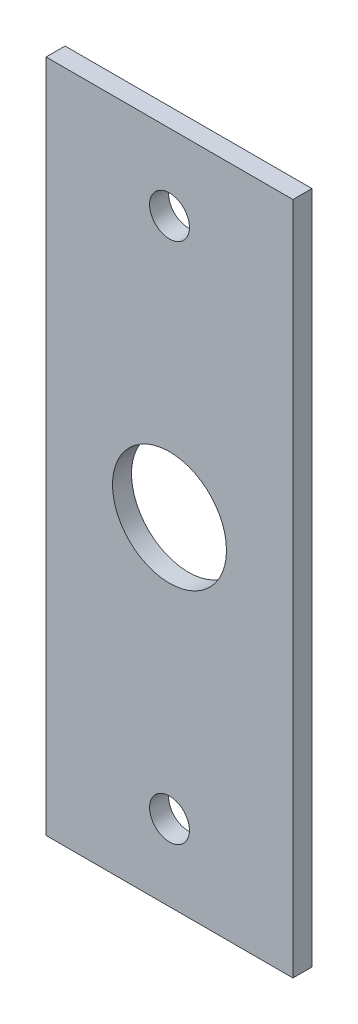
ISO-10303-21;
HEADER;
FILE_DESCRIPTION(('STEP AP214'),'2;1');
FILE_NAME('part.step','',(''),(''),'','','');
FILE_SCHEMA(('AUTOMOTIVE_DESIGN { 1 0 10303 214 1 1 1 1 }'));
ENDSEC;
DATA;
#1=APPLICATION_CONTEXT('core data for automotive mechanical design processes');
#2=APPLICATION_PROTOCOL_DEFINITION('international standard','automotive_design',2000,#1);
#3=PRODUCT_CONTEXT('',#1,'mechanical');
#4=PRODUCT('Part','Part','',(#3));
#5=PRODUCT_RELATED_PRODUCT_CATEGORY('part','',(#4));
#6=PRODUCT_DEFINITION_FORMATION('','',#4);
#7=PRODUCT_DEFINITION_CONTEXT('part definition',#1,'design');
#8=PRODUCT_DEFINITION('design','',#6,#7);
#9=PRODUCT_DEFINITION_SHAPE('','',#8);
#10=(LENGTH_UNIT() NAMED_UNIT(*) SI_UNIT(.MILLI.,.METRE.));
#11=(NAMED_UNIT(*) PLANE_ANGLE_UNIT() SI_UNIT($,.RADIAN.));
#12=(NAMED_UNIT(*) SI_UNIT($,.STERADIAN.) SOLID_ANGLE_UNIT());
#13=UNCERTAINTY_MEASURE_WITH_UNIT(LENGTH_MEASURE(1.E-05),#10,'distance_accuracy_value','');
#14=(GEOMETRIC_REPRESENTATION_CONTEXT(3) GLOBAL_UNCERTAINTY_ASSIGNED_CONTEXT((#13)) GLOBAL_UNIT_ASSIGNED_CONTEXT((#10,
#11,#12)) REPRESENTATION_CONTEXT('',''));
#15=CARTESIAN_POINT('',(0.,0.,0.));
#16=DIRECTION('',(0.,0.,1.));
#17=DIRECTION('',(1.,0.,0.));
#18=AXIS2_PLACEMENT_3D('',#15,#16,#17);
#19=CARTESIAN_POINT('',(-15.,35.5,2.));
#20=DIRECTION('',(0.,-1.,0.));
#21=DIRECTION('',(0.,0.,-1.));
#22=AXIS2_PLACEMENT_3D('',#19,#20,#21);
#23=PLANE('',#22);
#24=DIRECTION('',(0.,0.,-1.));
#25=VECTOR('',#24,1.);
#26=CARTESIAN_POINT('',(-13.,35.5,2.));
#27=LINE('',#26,#25);
#28=CARTESIAN_POINT('',(-13.,35.5,2.));
#29=VERTEX_POINT('',#28);
#30=CARTESIAN_POINT('',(-13.,35.5,0.));
#31=VERTEX_POINT('',#30);
#32=EDGE_CURVE('E57',#29,#31,#27,.T.);
#33=ORIENTED_EDGE('',*,*,#32,.F.);
#34=DIRECTION('',(-1.,0.,0.));
#35=VECTOR('',#34,1.);
#36=CARTESIAN_POINT('',(-15.,35.5,2.));
#37=LINE('',#36,#35);
#38=CARTESIAN_POINT('',(13.,35.5,2.));
#39=VERTEX_POINT('',#38);
#40=EDGE_CURVE('E49',#39,#29,#37,.T.);
#41=ORIENTED_EDGE('',*,*,#40,.F.);
#42=DIRECTION('',(0.,0.,1.));
#43=VECTOR('',#42,1.);
#44=CARTESIAN_POINT('',(13.,35.5,0.));
#45=LINE('',#44,#43);
#46=CARTESIAN_POINT('',(13.,35.5,0.));
#47=VERTEX_POINT('',#46);
#48=EDGE_CURVE('E122',#47,#39,#45,.T.);
#49=ORIENTED_EDGE('',*,*,#48,.F.);
#50=DIRECTION('',(-1.,0.,0.));
#51=VECTOR('',#50,1.);
#52=CARTESIAN_POINT('',(-15.,35.5,0.));
#53=LINE('',#52,#51);
#54=EDGE_CURVE('E95',#47,#31,#53,.T.);
#55=ORIENTED_EDGE('',*,*,#54,.T.);
#56=EDGE_LOOP('',(#33,#41,#49,#55));
#57=FACE_BOUND('',#56,.T.);
#58=ADVANCED_FACE('F41',(#57),#23,.F.);
#59=CARTESIAN_POINT('',(-15.,-35.5,2.));
#60=DIRECTION('',(0.,1.,0.));
#61=DIRECTION('',(0.,0.,1.));
#62=AXIS2_PLACEMENT_3D('',#59,#60,#61);
#63=PLANE('',#62);
#64=DIRECTION('',(0.,0.,1.));
#65=VECTOR('',#64,1.);
#66=CARTESIAN_POINT('',(-13.,-35.5,0.));
#67=LINE('',#66,#65);
#68=CARTESIAN_POINT('',(-13.,-35.5,0.));
#69=VERTEX_POINT('',#68);
#70=CARTESIAN_POINT('',(-13.,-35.5,2.));
#71=VERTEX_POINT('',#70);
#72=EDGE_CURVE('E82',#69,#71,#67,.T.);
#73=ORIENTED_EDGE('',*,*,#72,.F.);
#74=DIRECTION('',(1.,0.,0.));
#75=VECTOR('',#74,1.);
#76=CARTESIAN_POINT('',(-15.,-35.5,0.));
#77=LINE('',#76,#75);
#78=CARTESIAN_POINT('',(13.,-35.5,0.));
#79=VERTEX_POINT('',#78);
#80=EDGE_CURVE('E44',#69,#79,#77,.T.);
#81=ORIENTED_EDGE('',*,*,#80,.T.);
#82=DIRECTION('',(0.,0.,-1.));
#83=VECTOR('',#82,1.);
#84=CARTESIAN_POINT('',(13.,-35.5,2.));
#85=LINE('',#84,#83);
#86=CARTESIAN_POINT('',(13.,-35.5,2.));
#87=VERTEX_POINT('',#86);
#88=EDGE_CURVE('E125',#87,#79,#85,.T.);
#89=ORIENTED_EDGE('',*,*,#88,.F.);
#90=DIRECTION('',(1.,0.,0.));
#91=VECTOR('',#90,1.);
#92=CARTESIAN_POINT('',(-15.,-35.5,2.));
#93=LINE('',#92,#91);
#94=EDGE_CURVE('E11',#71,#87,#93,.T.);
#95=ORIENTED_EDGE('',*,*,#94,.F.);
#96=EDGE_LOOP('',(#73,#81,#89,#95));
#97=FACE_BOUND('',#96,.T.);
#98=ADVANCED_FACE('F89',(#97),#63,.F.);
#99=CARTESIAN_POINT('',(0.,0.,2.));
#100=DIRECTION('',(0.,0.,1.));
#101=DIRECTION('',(1.,0.,0.));
#102=AXIS2_PLACEMENT_3D('',#99,#100,#101);
#103=PLANE('',#102);
#104=CARTESIAN_POINT('',(0.,27.5,2.));
#105=DIRECTION('',(0.,0.,1.));
#106=DIRECTION('',(1.,0.,0.));
#107=AXIS2_PLACEMENT_3D('',#104,#105,#106);
#108=CIRCLE('',#107,2.1);
#109=CARTESIAN_POINT('',(2.1,27.5,2.));
#110=VERTEX_POINT('',#109);
#111=EDGE_CURVE('E116',#110,#110,#108,.T.);
#112=ORIENTED_EDGE('',*,*,#111,.F.);
#113=EDGE_LOOP('',(#112));
#114=FACE_BOUND('',#113,.T.);
#115=CARTESIAN_POINT('',(0.,-27.5,2.));
#116=DIRECTION('',(0.,0.,1.));
#117=DIRECTION('',(1.,0.,0.));
#118=AXIS2_PLACEMENT_3D('',#115,#116,#117);
#119=CIRCLE('',#118,2.1);
#120=CARTESIAN_POINT('',(2.1,-27.5,2.));
#121=VERTEX_POINT('',#120);
#122=EDGE_CURVE('E110',#121,#121,#119,.T.);
#123=ORIENTED_EDGE('',*,*,#122,.F.);
#124=EDGE_LOOP('',(#123));
#125=FACE_BOUND('',#124,.T.);
#126=CARTESIAN_POINT('',(0.,0.,2.));
#127=DIRECTION('',(0.,0.,1.));
#128=DIRECTION('',(1.,0.,0.));
#129=AXIS2_PLACEMENT_3D('',#126,#127,#128);
#130=CIRCLE('',#129,6.);
#131=CARTESIAN_POINT('',(6.,0.,2.));
#132=VERTEX_POINT('',#131);
#133=EDGE_CURVE('E102',#132,#132,#130,.T.);
#134=ORIENTED_EDGE('',*,*,#133,.F.);
#135=EDGE_LOOP('',(#134));
#136=FACE_BOUND('',#135,.T.);
#137=ORIENTED_EDGE('',*,*,#40,.T.);
#138=DIRECTION('',(0.,1.,0.));
#139=VECTOR('',#138,1.);
#140=CARTESIAN_POINT('',(-13.,-35.5,2.));
#141=LINE('',#140,#139);
#142=EDGE_CURVE('E90',#71,#29,#141,.T.);
#143=ORIENTED_EDGE('',*,*,#142,.F.);
#144=ORIENTED_EDGE('',*,*,#94,.T.);
#145=DIRECTION('',(0.,-1.,0.));
#146=VECTOR('',#145,1.);
#147=CARTESIAN_POINT('',(13.,35.5,2.));
#148=LINE('',#147,#146);
#149=EDGE_CURVE('E119',#39,#87,#148,.T.);
#150=ORIENTED_EDGE('',*,*,#149,.F.);
#151=EDGE_LOOP('',(#137,#143,#144,#150));
#152=FACE_BOUND('',#151,.T.);
#153=ADVANCED_FACE('F131',(#114,#125,#136,#152),#103,.T.);
#154=CARTESIAN_POINT('',(0.,0.,0.));
#155=DIRECTION('',(0.,0.,1.));
#156=DIRECTION('',(1.,0.,0.));
#157=AXIS2_PLACEMENT_3D('',#154,#155,#156);
#158=PLANE('',#157);
#159=CARTESIAN_POINT('',(0.,27.5,0.));
#160=DIRECTION('',(0.,0.,1.));
#161=DIRECTION('',(1.,0.,0.));
#162=AXIS2_PLACEMENT_3D('',#159,#160,#161);
#163=CIRCLE('',#162,2.1);
#164=CARTESIAN_POINT('',(2.1,27.5,0.));
#165=VERTEX_POINT('',#164);
#166=EDGE_CURVE('E113',#165,#165,#163,.T.);
#167=ORIENTED_EDGE('',*,*,#166,.T.);
#168=EDGE_LOOP('',(#167));
#169=FACE_BOUND('',#168,.T.);
#170=CARTESIAN_POINT('',(0.,-27.5,0.));
#171=DIRECTION('',(0.,0.,1.));
#172=DIRECTION('',(1.,0.,0.));
#173=AXIS2_PLACEMENT_3D('',#170,#171,#172);
#174=CIRCLE('',#173,2.1);
#175=CARTESIAN_POINT('',(2.1,-27.5,0.));
#176=VERTEX_POINT('',#175);
#177=EDGE_CURVE('E106',#176,#176,#174,.T.);
#178=ORIENTED_EDGE('',*,*,#177,.T.);
#179=EDGE_LOOP('',(#178));
#180=FACE_BOUND('',#179,.T.);
#181=CARTESIAN_POINT('',(0.,0.,0.));
#182=DIRECTION('',(0.,0.,1.));
#183=DIRECTION('',(1.,0.,0.));
#184=AXIS2_PLACEMENT_3D('',#181,#182,#183);
#185=CIRCLE('',#184,6.);
#186=CARTESIAN_POINT('',(6.,0.,0.));
#187=VERTEX_POINT('',#186);
#188=EDGE_CURVE('E98',#187,#187,#185,.T.);
#189=ORIENTED_EDGE('',*,*,#188,.T.);
#190=EDGE_LOOP('',(#189));
#191=FACE_BOUND('',#190,.T.);
#192=DIRECTION('',(0.,-1.,0.));
#193=VECTOR('',#192,1.);
#194=CARTESIAN_POINT('',(-13.,35.5,0.));
#195=LINE('',#194,#193);
#196=EDGE_CURVE('E80',#31,#69,#195,.T.);
#197=ORIENTED_EDGE('',*,*,#196,.F.);
#198=ORIENTED_EDGE('',*,*,#54,.F.);
#199=DIRECTION('',(0.,1.,0.));
#200=VECTOR('',#199,1.);
#201=CARTESIAN_POINT('',(13.,-35.5,0.));
#202=LINE('',#201,#200);
#203=EDGE_CURVE('E94',#79,#47,#202,.T.);
#204=ORIENTED_EDGE('',*,*,#203,.F.);
#205=ORIENTED_EDGE('',*,*,#80,.F.);
#206=EDGE_LOOP('',(#197,#198,#204,#205));
#207=FACE_BOUND('',#206,.T.);
#208=ADVANCED_FACE('F93',(#169,#180,#191,#207),#158,.F.);
#209=CARTESIAN_POINT('',(0.,0.,0.));
#210=DIRECTION('',(0.,0.,1.));
#211=DIRECTION('',(1.,0.,0.));
#212=AXIS2_PLACEMENT_3D('',#209,#210,#211);
#213=CYLINDRICAL_SURFACE('',#212,6.);
#214=ORIENTED_EDGE('',*,*,#188,.F.);
#215=EDGE_LOOP('',(#214));
#216=FACE_BOUND('',#215,.T.);
#217=ORIENTED_EDGE('',*,*,#133,.T.);
#218=EDGE_LOOP('',(#217));
#219=FACE_BOUND('',#218,.T.);
#220=ADVANCED_FACE('F156',(#216,#219),#213,.F.);
#221=CARTESIAN_POINT('',(0.,-27.5,2.));
#222=DIRECTION('',(0.,0.,1.));
#223=DIRECTION('',(1.,0.,0.));
#224=AXIS2_PLACEMENT_3D('',#221,#222,#223);
#225=CYLINDRICAL_SURFACE('',#224,2.1);
#226=ORIENTED_EDGE('',*,*,#177,.F.);
#227=EDGE_LOOP('',(#226));
#228=FACE_BOUND('',#227,.T.);
#229=ORIENTED_EDGE('',*,*,#122,.T.);
#230=EDGE_LOOP('',(#229));
#231=FACE_BOUND('',#230,.T.);
#232=ADVANCED_FACE('F143',(#228,#231),#225,.F.);
#233=CARTESIAN_POINT('',(0.,27.5,2.));
#234=DIRECTION('',(0.,0.,1.));
#235=DIRECTION('',(1.,0.,0.));
#236=AXIS2_PLACEMENT_3D('',#233,#234,#235);
#237=CYLINDRICAL_SURFACE('',#236,2.1);
#238=ORIENTED_EDGE('',*,*,#166,.F.);
#239=EDGE_LOOP('',(#238));
#240=FACE_BOUND('',#239,.T.);
#241=ORIENTED_EDGE('',*,*,#111,.T.);
#242=EDGE_LOOP('',(#241));
#243=FACE_BOUND('',#242,.T.);
#244=ADVANCED_FACE('F135',(#240,#243),#237,.F.);
#245=CARTESIAN_POINT('',(13.,0.,0.));
#246=DIRECTION('',(1.,0.,0.));
#247=DIRECTION('',(0.,1.,0.));
#248=AXIS2_PLACEMENT_3D('',#245,#246,#247);
#249=PLANE('',#248);
#250=ORIENTED_EDGE('',*,*,#88,.T.);
#251=ORIENTED_EDGE('',*,*,#203,.T.);
#252=ORIENTED_EDGE('',*,*,#48,.T.);
#253=ORIENTED_EDGE('',*,*,#149,.T.);
#254=EDGE_LOOP('',(#250,#251,#252,#253));
#255=FACE_BOUND('',#254,.T.);
#256=ADVANCED_FACE('F133',(#255),#249,.T.);
#257=CARTESIAN_POINT('',(-13.,0.,0.));
#258=DIRECTION('',(-1.,0.,0.));
#259=DIRECTION('',(0.,-1.,0.));
#260=AXIS2_PLACEMENT_3D('',#257,#258,#259);
#261=PLANE('',#260);
#262=ORIENTED_EDGE('',*,*,#32,.T.);
#263=ORIENTED_EDGE('',*,*,#196,.T.);
#264=ORIENTED_EDGE('',*,*,#72,.T.);
#265=ORIENTED_EDGE('',*,*,#142,.T.);
#266=EDGE_LOOP('',(#262,#263,#264,#265));
#267=FACE_BOUND('',#266,.T.);
#268=ADVANCED_FACE('F81',(#267),#261,.T.);
#269=CLOSED_SHELL('',(#58,#98,#153,#208,#220,#232,#244,#256,#268));
#270=MANIFOLD_SOLID_BREP('B2',#269);
#271=ADVANCED_BREP_SHAPE_REPRESENTATION('',(#18,#270),#14);
#272=SHAPE_DEFINITION_REPRESENTATION(#9,#271);
ENDSEC;
END-ISO-10303-21;
